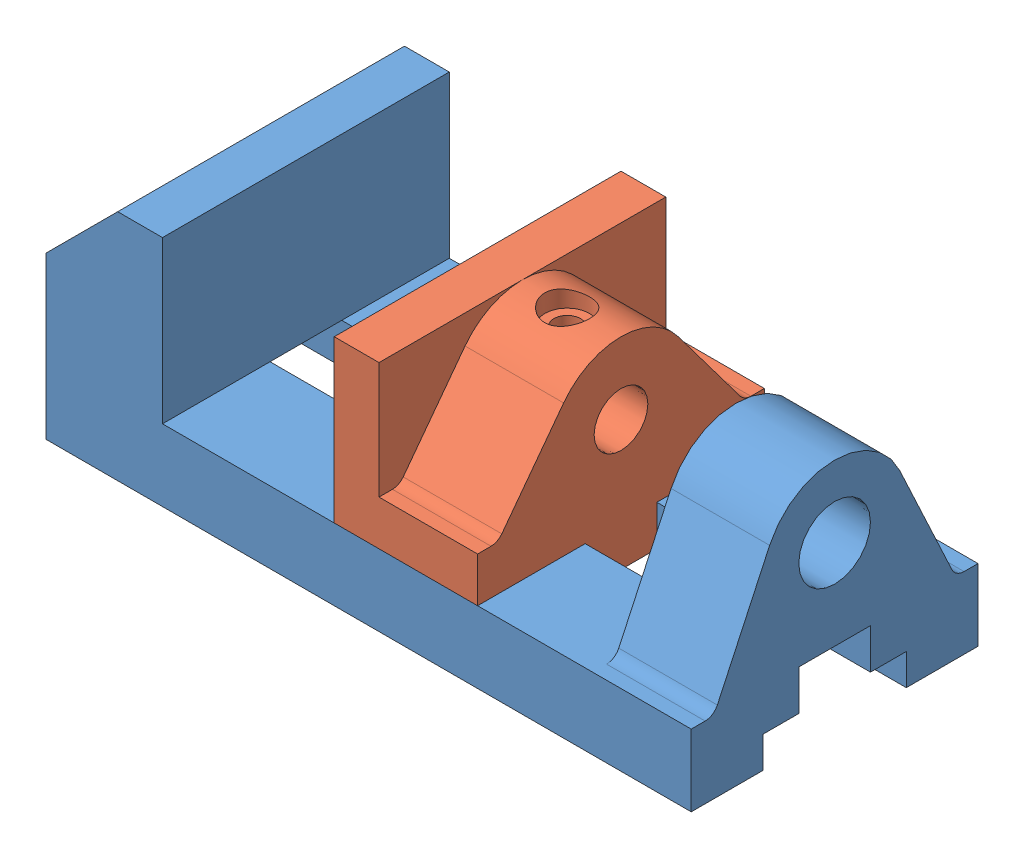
SolidWorks assembly Assem3.SLDASM, configuration Default (file format 11000). Lengths in mm.
Overall size (144 52 64).
2 component instances, 2 part files, 3 mates.
Components (placement in the parent):
- vice-body-1: vice-body.SLDPRT [Default] at (-165.9369 -6.4769 36.3055) size (144 52 64)
- vice-jaw-1: vice-jaw.SLDPRT [Default] at (-101.6145 23.5231 36.3055) x (0 0 -1) z (1 0 0) size (64 45 32)
Mates (geometry in assembly coordinates):
- Coincident11: coincident: plane of assembly; plane of assembly; plane of vice-body-1 through (-165.9369 0.5231 28.3055) normal (0 0 1); plane of vice-jaw-1 through (-69.6145 9.5231 28.3055) normal (0 0 -1)
- Coincident21: coincident: plane of assembly; plane of assembly; plane of vice-body-1 through (-21.9369 9.5231 68.3055) normal (0 1 0); plane of vice-jaw-1 through (-69.6145 9.5231 4.3055) normal (0 -1 0)
- Parallel11: parallel: plane of assembly; plane of assembly; plane of vice-body-1 through (-139.9369 9.5231 68.3055) normal (1 0 0); plane of vice-jaw-1 through (-101.6145 0.5231 4.3055) normal (-1 0 0)
